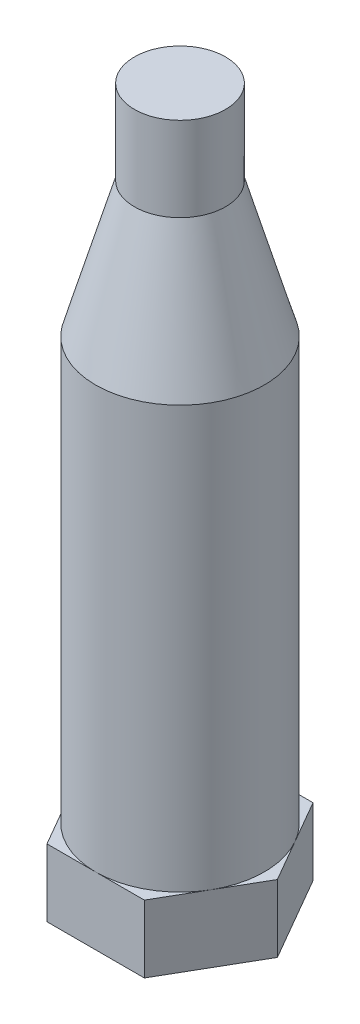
from build123d import *

# Parameters (mm, degrees)
EXTRUDE1_DEPTH = 5.08
SKETCH2_R      = 6.35
EXTRUDE2_DEPTH = 31.75


with BuildPart() as part:
    # Sketch1 → Extrude1 (new body)
    with BuildSketch(Plane(origin=(0, 0, 0), x_dir=(1, 0, 0), z_dir=(0, 1, 0))):
        Polygon((0, 0), (7.332348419, 0), (10.998522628, 6.35), (7.332348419, 12.7), (0, 12.7), (-3.666174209, 6.35), align=None)
    extrude(amount=EXTRUDE1_DEPTH)

    # Sketch2 → Extrude2 (add)
    with BuildSketch(Plane(origin=(0, 5.08, 0), x_dir=(1, 0, 0), z_dir=(0, 1, 0))):
        with Locations(Location((3.666174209, 6.35, 0), (0, 0, 270))):
            Circle(SKETCH2_R)
    extrude(amount=EXTRUDE2_DEPTH)

    # Sketch3 → Revolve1 (revolve)
    with BuildSketch(Plane(origin=(0, 0, -6.35), x_dir=(-1, 0, 0), z_dir=(0, 0, -1)), mode=Mode.PRIVATE) as revolve1_sk:
        Polygon((-10.016174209, 36.83), (-7.095174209, 46.99), (-7.095174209, 53.34), (-3.666174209, 53.34), (-3.666174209, 36.83), align=None)
    revolve(revolve1_sk.sketch.rotate(Axis((3.666174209, 0, -6.35), (0, 1, 0)), 90), axis=Axis((3.666174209, 0, -6.35), (0, 1, 0)))


solid = part.part
